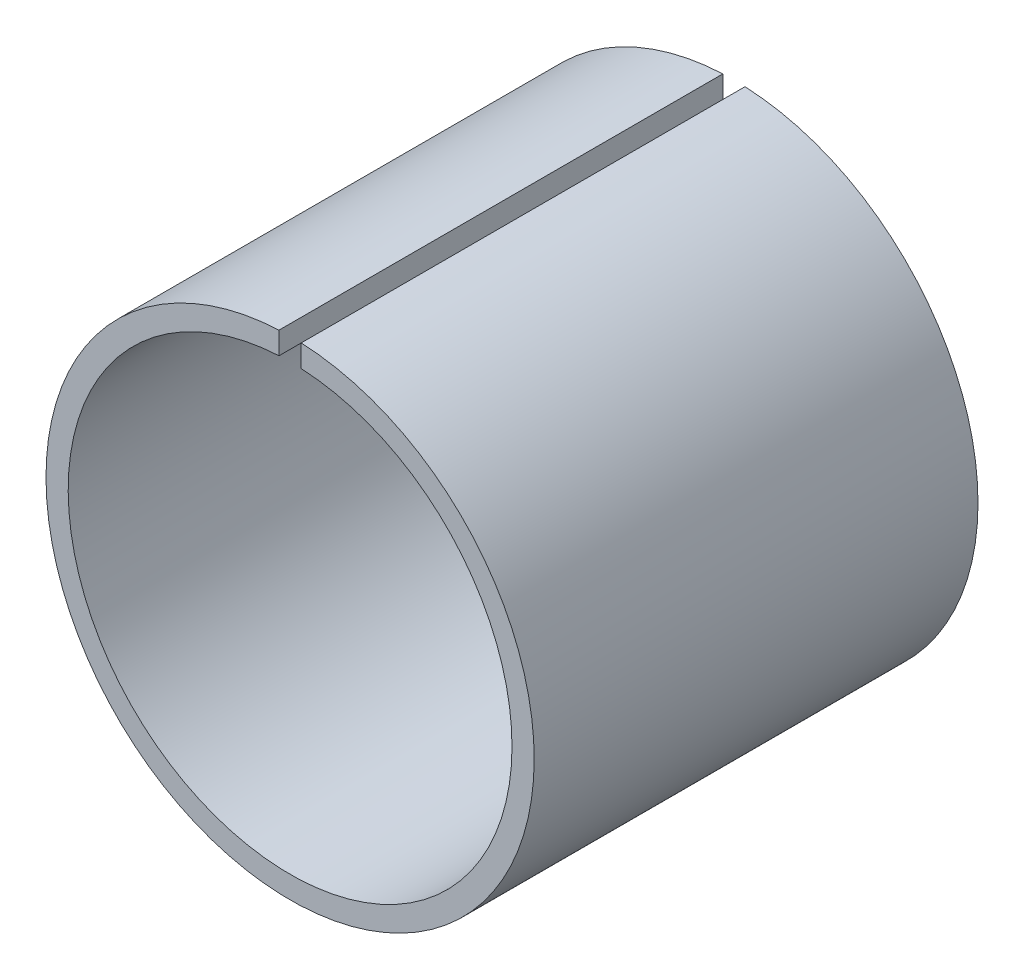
from build123d import *

# Parameters (mm, degrees)
SKIZZE1_R                       = 55
SKIZZE1_R_2                     = 50
AUFSATZ_LINEAR_AUSTRAGEN1_DEPTH = 100
SCHNITT_LINEAR_AUSTRAGEN1_DEPTH = 100


with BuildPart() as part:
    # Skizze1 → Aufsatz-Linear austragen1 (new body)
    with BuildSketch(Plane.XY):
        Circle(SKIZZE1_R)
        Circle(SKIZZE1_R_2, mode=Mode.SUBTRACT)
    extrude(amount=-AUFSATZ_LINEAR_AUSTRAGEN1_DEPTH)

    # Skizze2 → Schnitt-Linear austragen1 (cut)
    with BuildSketch(Plane.XY):
        with BuildLine():
            Line((2.5, 49.937460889), (2.5, 54.94315244))
            ThreePointArc((2.5, 54.94315244), (0, 55), (-2.5, 54.94315244))
            Line((-2.5, 54.94315244), (-2.5, 49.937460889))
            ThreePointArc((-2.5, 49.937460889), (0, 50), (2.5, 49.937460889))
        make_face()
    extrude(amount=-SCHNITT_LINEAR_AUSTRAGEN1_DEPTH, mode=Mode.SUBTRACT)


solid = part.part
